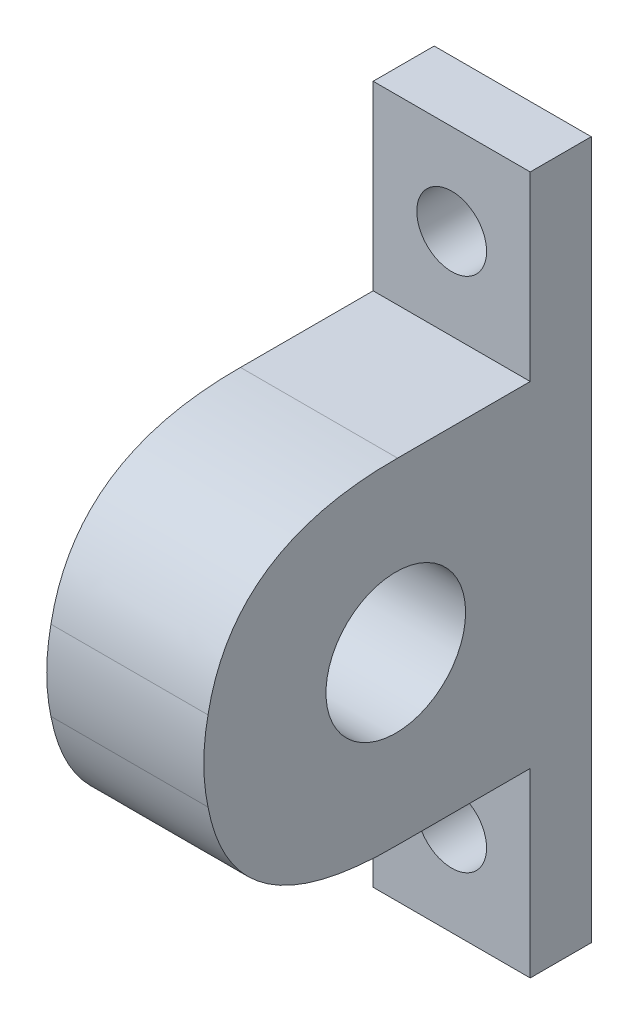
from build123d import *
from build123d.topology import SkipClean

# Parameters (mm, degrees)
SKETCH1_W           = 100
SKETCH1_H           = 22.5
BOSS_EXTRUDE1_DEPTH = 55.5
CUT_EXTRUDE1_DEPTH  = 79.016023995
CUT_EXTRUDE2_DEPTH  = 73.059409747
CUT_EXTRUDE3_DEPTH  = 73.059409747
SKETCH6_R           = 12
SKETCH6_R_2         = 10
BOSS_EXTRUDE2_DEPTH = 5


with BuildPart() as part:
    # Sketch1 → Boss-Extrude1 (new body)
    with BuildSketch(Plane(origin=(0, 0, 0), x_dir=(0, 1, 0), z_dir=(0, 0, 1))):
        with Locations((0, -11.25)):
            Rectangle(SKETCH1_W, SKETCH1_H)
    extrude(amount=BOSS_EXTRUDE1_DEPTH)

    # Sketch2 → Cut-Extrude1 (cut, through all)
    with BuildSketch(Plane.YZ.offset(22.5)):
        with BuildLine():
            Line((-50, 8.742021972), (-24, 8.742021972))
            Line((-24, 8.742021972), (-24, 14.574278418))
            ThreePointArc((-24, 14.574278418), (-27.5, 28), (-24, 41.425721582))
            Line((-24, 41.425721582), (-24, 55.5))
            Line((-24, 55.5), (-50, 55.5))
            Line((-50, 55.5), (-50, 8.742021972))
        make_face()
        with BuildLine():
            ThreePointArc((-24, 41.425721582), (-27.5, 28), (-24, 14.574278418))
            Line((-24, 14.574278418), (-24, 27.75))
            add(Edge.make_bspline(
                [(-24, 28.630883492), (-24.003292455, 28.193991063), (-24, 27.75)],
                knots=[0.983572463, 0.983572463, 0.983572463, 1, 1, 1], degree=2))
            Line((-24, 28.630883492), (-24, 41.425721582))
        make_face()
        with BuildLine():
            ThreePointArc((-15.102725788, 50.981681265), (-20.126720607, 46.73940014), (-24, 41.425721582))
            Line((-24, 41.425721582), (-24, 28.630883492))
            add(Edge.make_bspline(
                [(-15.102725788, 50.981681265), (-23.880610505, 44.473278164), (-24, 28.630883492)],
                knots=[0.387884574, 0.387884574, 0.387884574, 0.983572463, 0.983572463, 0.983572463], degree=2))
        make_face()
        with BuildLine():
            ThreePointArc((-24, 41.425721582), (-27.5, 28), (-24, 14.574278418))
            Line((-24, 14.574278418), (-24, 27.75))
            add(Edge.make_bspline(
                [(-24, 28.630883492), (-24.003292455, 28.193991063), (-24, 27.75)],
                knots=[0.983572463, 0.983572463, 0.983572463, 1, 1, 1], degree=2))
            Line((-24, 28.630883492), (-24, 41.425721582))
        make_face()
        with BuildLine():
            ThreePointArc((-15.102725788, 50.981681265), (-20.126720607, 46.73940014), (-24, 41.425721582))
            Line((-24, 41.425721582), (-24, 28.630883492))
            add(Edge.make_bspline(
                [(-15.102725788, 50.981681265), (-23.880610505, 44.473278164), (-24, 28.630883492)],
                knots=[0.387884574, 0.387884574, 0.387884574, 0.983572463, 0.983572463, 0.983572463], degree=2))
        make_face()
        with BuildLine():
            Line((-24, 55.5), (-24, 41.425721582))
            ThreePointArc((-24, 41.425721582), (-20.126720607, 46.73940014), (-15.102725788, 50.981681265))
            add(Edge.make_bspline(
                [(-5.719329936, 54.898685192), (-11.246534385, 53.840872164), (-15.102725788, 50.981681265)],
                knots=[0.126194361, 0.126194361, 0.126194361, 0.387884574, 0.387884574, 0.387884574], degree=2))
            ThreePointArc((-5.719329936, 54.898685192), (-2.875426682, 55.349258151), (0, 55.5))
            Line((0, 55.5), (-24, 55.5))
        make_face()
        with BuildLine():
            ThreePointArc((0, 38), (-10, 28), (0, 18))
            Line((0, 18), (0, 38))
        make_face()
        with BuildLine():
            Line((0, 38), (0, 18))
            ThreePointArc((0, 18), (7.071067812, 20.928932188), (10, 28))
            ThreePointArc((10, 28), (7.071067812, 35.071067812), (0, 38))
        make_face()
        with BuildLine():
            ThreePointArc((0, 38), (-10, 28), (0, 18))
            Line((0, 18), (0, 38))
        make_face()
        with BuildLine():
            Line((0, 38), (0, 18))
            ThreePointArc((0, 18), (7.071067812, 20.928932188), (10, 28))
            ThreePointArc((10, 28), (7.071067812, 35.071067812), (0, 38))
        make_face()
        with BuildLine():
            Line((24, 55.5), (0, 55.5))
            ThreePointArc((0, 55.5), (2.875426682, 55.349258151), (5.719329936, 54.898685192))
            add(Edge.make_bspline(
                [(5.719329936, 54.898685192), (11.246534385, 53.840872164), (15.102725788, 50.981681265)],
                knots=[0.126194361, 0.126194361, 0.126194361, 0.387884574, 0.387884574, 0.387884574], degree=2))
            ThreePointArc((15.102725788, 50.981681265), (20.126720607, 46.73940014), (24, 41.425721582))
            Line((24, 41.425721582), (24, 55.5))
        make_face()
        with BuildLine():
            Line((24, 14.574278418), (24, 8.742021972))
            Line((24, 8.742021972), (50, 8.742021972))
            Line((50, 8.742021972), (50, 14.574278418))
            Line((50, 14.574278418), (50, 55.5))
            Line((50, 55.5), (24, 55.5))
            Line((24, 55.5), (24, 41.425721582))
            ThreePointArc((24, 41.425721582), (26.610618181, 34.937218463), (27.5, 28))
            ThreePointArc((27.5, 28), (26.610618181, 21.062781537), (24, 14.574278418))
        make_face()
        with BuildLine():
            Line((24, 27.75), (24, 14.574278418))
            ThreePointArc((24, 14.574278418), (26.610618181, 21.062781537), (27.5, 28))
            ThreePointArc((27.5, 28), (26.610618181, 34.937218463), (24, 41.425721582))
            Line((24, 41.425721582), (24, 28.630883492))
            add(Edge.make_bspline(
                [(24, 28.630883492), (24.003292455, 28.193991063), (24, 27.75)],
                knots=[0.983572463, 0.983572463, 0.983572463, 1, 1, 1], degree=2))
        make_face()
        with BuildLine():
            ThreePointArc((24, 41.425721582), (20.126720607, 46.73940014), (15.102725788, 50.981681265))
            add(Edge.make_bspline(
                [(15.102725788, 50.981681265), (23.880610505, 44.473278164), (24, 28.630883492)],
                knots=[0.387884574, 0.387884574, 0.387884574, 0.983572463, 0.983572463, 0.983572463], degree=2))
            Line((24, 28.630883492), (24, 41.425721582))
        make_face()
        with BuildLine():
            Line((24, 27.75), (24, 14.574278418))
            ThreePointArc((24, 14.574278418), (26.610618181, 21.062781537), (27.5, 28))
            ThreePointArc((27.5, 28), (26.610618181, 34.937218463), (24, 41.425721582))
            Line((24, 41.425721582), (24, 28.630883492))
            add(Edge.make_bspline(
                [(24, 28.630883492), (24.003292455, 28.193991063), (24, 27.75)],
                knots=[0.983572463, 0.983572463, 0.983572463, 1, 1, 1], degree=2))
        make_face()
        with BuildLine():
            ThreePointArc((24, 41.425721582), (20.126720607, 46.73940014), (15.102725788, 50.981681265))
            add(Edge.make_bspline(
                [(15.102725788, 50.981681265), (23.880610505, 44.473278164), (24, 28.630883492)],
                knots=[0.387884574, 0.387884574, 0.387884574, 0.983572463, 0.983572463, 0.983572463], degree=2))
            Line((24, 28.630883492), (24, 41.425721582))
        make_face()
    extrude(amount=-CUT_EXTRUDE1_DEPTH, mode=Mode.SUBTRACT)

    # Sketch3 → Cut-Extrude2 (cut, through all)
    with BuildSketch(Plane.XY.offset(8.742021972)):
        with BuildLine():
            ThreePointArc((16.25, 37), (15.797494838, 39.078530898), (14.521883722, 40.780843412))
            Line((14.521883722, 40.780843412), (7.978116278, 33.219156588))
            ThreePointArc((7.978116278, 33.219156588), (13.328530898, 32.452505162), (16.25, 37))
        make_face()
        with BuildLine():
            Line((7.978116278, 33.219156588), (14.521883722, 40.780843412))
            ThreePointArc((14.521883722, 40.780843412), (7.469156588, 40.271883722), (7.978116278, 33.219156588))
        make_face()
        with BuildLine():
            ThreePointArc((16.25, 37), (15.797494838, 39.078530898), (14.521883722, 40.780843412))
            Line((14.521883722, 40.780843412), (7.978116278, 33.219156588))
            ThreePointArc((7.978116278, 33.219156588), (13.328530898, 32.452505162), (16.25, 37))
        make_face()
        with BuildLine():
            Line((7.978116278, 33.219156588), (14.521883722, 40.780843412))
            ThreePointArc((14.521883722, 40.780843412), (7.469156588, 40.271883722), (7.978116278, 33.219156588))
        make_face()
    extrude(amount=-CUT_EXTRUDE2_DEPTH, mode=Mode.SUBTRACT)

    # Sketch5 → Cut-Extrude3 (cut, through all)
    with BuildSketch(Plane.XY.offset(8.742021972)):
        with BuildLine():
            ThreePointArc((16.248437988, -37), (13.32788156, -32.45392581), (7.979138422, -33.220337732))
            Line((7.979138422, -33.220337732), (14.520861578, -40.779662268))
            ThreePointArc((14.520861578, -40.779662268), (15.79607419, -39.07788156), (16.248437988, -37))
        make_face()
        with BuildLine():
            Line((14.520861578, -40.779662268), (7.979138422, -33.220337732))
            ThreePointArc((7.979138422, -33.220337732), (7.470337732, -40.270861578), (14.520861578, -40.779662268))
        make_face()
        with BuildLine():
            ThreePointArc((16.248437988, -37), (13.32788156, -32.45392581), (7.979138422, -33.220337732))
            Line((7.979138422, -33.220337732), (14.520861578, -40.779662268))
            ThreePointArc((14.520861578, -40.779662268), (15.79607419, -39.07788156), (16.248437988, -37))
        make_face()
        with BuildLine():
            Line((14.520861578, -40.779662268), (7.979138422, -33.220337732))
            ThreePointArc((7.979138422, -33.220337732), (7.470337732, -40.270861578), (14.520861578, -40.779662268))
        make_face()
    extrude(amount=-CUT_EXTRUDE3_DEPTH, mode=Mode.SUBTRACT)

    # Sketch6 → Boss-Extrude2 (add)
    with SkipClean():  # the faces are left unmerged after this step: merging them gives an invalid solid
        with BuildSketch(Plane(origin=(0, 0, 0), x_dir=(0, -1, 0), z_dir=(-1, 0, 0))):
            with Locations(Location((0, 28, 0), (0, 0, 270))):
                Circle(SKETCH6_R)
            with Locations(Location((0, 28, 0), (0, 0, 270))):
                Circle(SKETCH6_R_2, mode=Mode.SUBTRACT)
        extrude(amount=BOSS_EXTRUDE2_DEPTH)


solid = part.part
